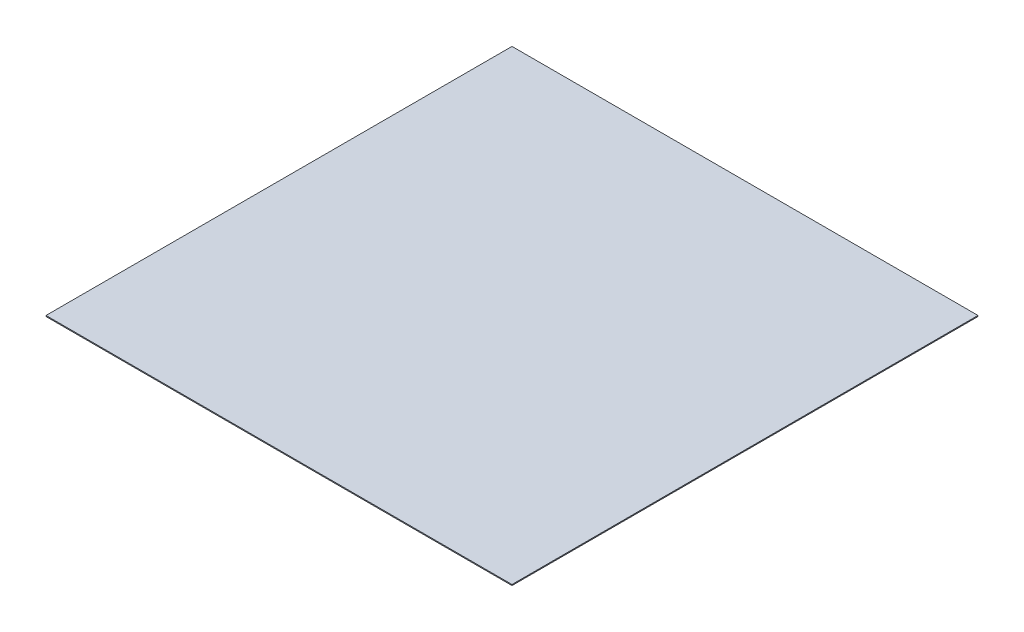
ISO-10303-21;
HEADER;
FILE_DESCRIPTION(('STEP AP214'),'2;1');
FILE_NAME('part.step','',(''),(''),'','','');
FILE_SCHEMA(('AUTOMOTIVE_DESIGN { 1 0 10303 214 1 1 1 1 }'));
ENDSEC;
DATA;
#1=APPLICATION_CONTEXT('core data for automotive mechanical design processes');
#2=APPLICATION_PROTOCOL_DEFINITION('international standard','automotive_design',2000,#1);
#3=PRODUCT_CONTEXT('',#1,'mechanical');
#4=PRODUCT('Part','Part','',(#3));
#5=PRODUCT_RELATED_PRODUCT_CATEGORY('part','',(#4));
#6=PRODUCT_DEFINITION_FORMATION('','',#4);
#7=PRODUCT_DEFINITION_CONTEXT('part definition',#1,'design');
#8=PRODUCT_DEFINITION('design','',#6,#7);
#9=PRODUCT_DEFINITION_SHAPE('','',#8);
#10=(LENGTH_UNIT() NAMED_UNIT(*) SI_UNIT(.MILLI.,.METRE.));
#11=(NAMED_UNIT(*) PLANE_ANGLE_UNIT() SI_UNIT($,.RADIAN.));
#12=(NAMED_UNIT(*) SI_UNIT($,.STERADIAN.) SOLID_ANGLE_UNIT());
#13=UNCERTAINTY_MEASURE_WITH_UNIT(LENGTH_MEASURE(1.E-05),#10,'distance_accuracy_value','');
#14=(GEOMETRIC_REPRESENTATION_CONTEXT(3) GLOBAL_UNCERTAINTY_ASSIGNED_CONTEXT((#13)) GLOBAL_UNIT_ASSIGNED_CONTEXT((#10,
#11,#12)) REPRESENTATION_CONTEXT('',''));
#15=CARTESIAN_POINT('',(0.,0.,0.));
#16=DIRECTION('',(0.,0.,1.));
#17=DIRECTION('',(1.,0.,0.));
#18=AXIS2_PLACEMENT_3D('',#15,#16,#17);
#19=CARTESIAN_POINT('',(-304.8,-1.27,304.8));
#20=DIRECTION('',(0.,1.,0.));
#21=DIRECTION('',(0.,0.,1.));
#22=AXIS2_PLACEMENT_3D('',#19,#20,#21);
#23=PLANE('',#22);
#24=DIRECTION('',(1.,0.,0.));
#25=VECTOR('',#24,1.);
#26=CARTESIAN_POINT('',(-304.8,-1.27,-304.8));
#27=LINE('',#26,#25);
#28=CARTESIAN_POINT('',(-304.8,-1.27,-304.8));
#29=VERTEX_POINT('',#28);
#30=CARTESIAN_POINT('',(304.8,-1.27,-304.8));
#31=VERTEX_POINT('',#30);
#32=EDGE_CURVE('E79',#29,#31,#27,.T.);
#33=ORIENTED_EDGE('',*,*,#32,.T.);
#34=DIRECTION('',(0.,0.,-1.));
#35=VECTOR('',#34,1.);
#36=CARTESIAN_POINT('',(304.8,-1.27,304.8));
#37=LINE('',#36,#35);
#38=CARTESIAN_POINT('',(304.8,-1.27,304.8));
#39=VERTEX_POINT('',#38);
#40=EDGE_CURVE('E11',#39,#31,#37,.T.);
#41=ORIENTED_EDGE('',*,*,#40,.F.);
#42=DIRECTION('',(1.,0.,0.));
#43=VECTOR('',#42,1.);
#44=CARTESIAN_POINT('',(-304.8,-1.27,304.8));
#45=LINE('',#44,#43);
#46=CARTESIAN_POINT('',(-304.8,-1.27,304.8));
#47=VERTEX_POINT('',#46);
#48=EDGE_CURVE('E90',#47,#39,#45,.T.);
#49=ORIENTED_EDGE('',*,*,#48,.F.);
#50=DIRECTION('',(0.,0.,-1.));
#51=VECTOR('',#50,1.);
#52=CARTESIAN_POINT('',(-304.8,-1.27,304.8));
#53=LINE('',#52,#51);
#54=EDGE_CURVE('E42',#47,#29,#53,.T.);
#55=ORIENTED_EDGE('',*,*,#54,.T.);
#56=EDGE_LOOP('',(#33,#41,#49,#55));
#57=FACE_BOUND('',#56,.T.);
#58=ADVANCED_FACE('F28',(#57),#23,.F.);
#59=CARTESIAN_POINT('',(304.8,0.,304.8));
#60=DIRECTION('',(1.,0.,0.));
#61=DIRECTION('',(0.,0.,-1.));
#62=AXIS2_PLACEMENT_3D('',#59,#60,#61);
#63=PLANE('',#62);
#64=DIRECTION('',(0.,-1.,0.));
#65=VECTOR('',#64,1.);
#66=CARTESIAN_POINT('',(304.8,0.,-304.8));
#67=LINE('',#66,#65);
#68=CARTESIAN_POINT('',(304.8,0.,-304.8));
#69=VERTEX_POINT('',#68);
#70=EDGE_CURVE('E73',#69,#31,#67,.T.);
#71=ORIENTED_EDGE('',*,*,#70,.F.);
#72=DIRECTION('',(0.,0.,-1.));
#73=VECTOR('',#72,1.);
#74=CARTESIAN_POINT('',(304.8,0.,304.8));
#75=LINE('',#74,#73);
#76=CARTESIAN_POINT('',(304.8,0.,304.8));
#77=VERTEX_POINT('',#76);
#78=EDGE_CURVE('E35',#77,#69,#75,.T.);
#79=ORIENTED_EDGE('',*,*,#78,.F.);
#80=DIRECTION('',(0.,-1.,0.));
#81=VECTOR('',#80,1.);
#82=CARTESIAN_POINT('',(304.8,0.,304.8));
#83=LINE('',#82,#81);
#84=EDGE_CURVE('E76',#77,#39,#83,.T.);
#85=ORIENTED_EDGE('',*,*,#84,.T.);
#86=ORIENTED_EDGE('',*,*,#40,.T.);
#87=EDGE_LOOP('',(#71,#79,#85,#86));
#88=FACE_BOUND('',#87,.T.);
#89=ADVANCED_FACE('F71',(#88),#63,.T.);
#90=CARTESIAN_POINT('',(-304.8,0.,304.8));
#91=DIRECTION('',(0.,1.,0.));
#92=DIRECTION('',(0.,0.,1.));
#93=AXIS2_PLACEMENT_3D('',#90,#91,#92);
#94=PLANE('',#93);
#95=DIRECTION('',(1.,0.,0.));
#96=VECTOR('',#95,1.);
#97=CARTESIAN_POINT('',(-304.8,0.,-304.8));
#98=LINE('',#97,#96);
#99=CARTESIAN_POINT('',(-304.8,0.,-304.8));
#100=VERTEX_POINT('',#99);
#101=EDGE_CURVE('E84',#100,#69,#98,.T.);
#102=ORIENTED_EDGE('',*,*,#101,.F.);
#103=DIRECTION('',(0.,0.,-1.));
#104=VECTOR('',#103,1.);
#105=CARTESIAN_POINT('',(-304.8,0.,304.8));
#106=LINE('',#105,#104);
#107=CARTESIAN_POINT('',(-304.8,0.,304.8));
#108=VERTEX_POINT('',#107);
#109=EDGE_CURVE('E50',#108,#100,#106,.T.);
#110=ORIENTED_EDGE('',*,*,#109,.F.);
#111=DIRECTION('',(1.,0.,0.));
#112=VECTOR('',#111,1.);
#113=CARTESIAN_POINT('',(-304.8,0.,304.8));
#114=LINE('',#113,#112);
#115=EDGE_CURVE('E93',#108,#77,#114,.T.);
#116=ORIENTED_EDGE('',*,*,#115,.T.);
#117=ORIENTED_EDGE('',*,*,#78,.T.);
#118=EDGE_LOOP('',(#102,#110,#116,#117));
#119=FACE_BOUND('',#118,.T.);
#120=ADVANCED_FACE('F98',(#119),#94,.T.);
#121=CARTESIAN_POINT('',(-304.8,-1.27,304.8));
#122=DIRECTION('',(-1.,0.,0.));
#123=DIRECTION('',(0.,0.,1.));
#124=AXIS2_PLACEMENT_3D('',#121,#122,#123);
#125=PLANE('',#124);
#126=DIRECTION('',(0.,1.,0.));
#127=VECTOR('',#126,1.);
#128=CARTESIAN_POINT('',(-304.8,-1.27,-304.8));
#129=LINE('',#128,#127);
#130=EDGE_CURVE('E86',#29,#100,#129,.T.);
#131=ORIENTED_EDGE('',*,*,#130,.F.);
#132=ORIENTED_EDGE('',*,*,#54,.F.);
#133=DIRECTION('',(0.,1.,0.));
#134=VECTOR('',#133,1.);
#135=CARTESIAN_POINT('',(-304.8,-1.27,304.8));
#136=LINE('',#135,#134);
#137=EDGE_CURVE('E95',#47,#108,#136,.T.);
#138=ORIENTED_EDGE('',*,*,#137,.T.);
#139=ORIENTED_EDGE('',*,*,#109,.T.);
#140=EDGE_LOOP('',(#131,#132,#138,#139));
#141=FACE_BOUND('',#140,.T.);
#142=ADVANCED_FACE('F102',(#141),#125,.T.);
#143=CARTESIAN_POINT('',(304.8,-1.27,304.8));
#144=DIRECTION('',(0.,0.,-1.));
#145=DIRECTION('',(-1.,0.,0.));
#146=AXIS2_PLACEMENT_3D('',#143,#144,#145);
#147=PLANE('',#146);
#148=ORIENTED_EDGE('',*,*,#48,.T.);
#149=ORIENTED_EDGE('',*,*,#84,.F.);
#150=ORIENTED_EDGE('',*,*,#115,.F.);
#151=ORIENTED_EDGE('',*,*,#137,.F.);
#152=EDGE_LOOP('',(#148,#149,#150,#151));
#153=FACE_BOUND('',#152,.T.);
#154=ADVANCED_FACE('F100',(#153),#147,.F.);
#155=CARTESIAN_POINT('',(304.8,-1.27,-304.8));
#156=DIRECTION('',(0.,0.,-1.));
#157=DIRECTION('',(-1.,0.,0.));
#158=AXIS2_PLACEMENT_3D('',#155,#156,#157);
#159=PLANE('',#158);
#160=ORIENTED_EDGE('',*,*,#32,.F.);
#161=ORIENTED_EDGE('',*,*,#130,.T.);
#162=ORIENTED_EDGE('',*,*,#101,.T.);
#163=ORIENTED_EDGE('',*,*,#70,.T.);
#164=EDGE_LOOP('',(#160,#161,#162,#163));
#165=FACE_BOUND('',#164,.T.);
#166=ADVANCED_FACE('F83',(#165),#159,.T.);
#167=CLOSED_SHELL('',(#58,#89,#120,#142,#154,#166));
#168=MANIFOLD_SOLID_BREP('B2',#167);
#169=ADVANCED_BREP_SHAPE_REPRESENTATION('',(#18,#168),#14);
#170=SHAPE_DEFINITION_REPRESENTATION(#9,#169);
ENDSEC;
END-ISO-10303-21;
